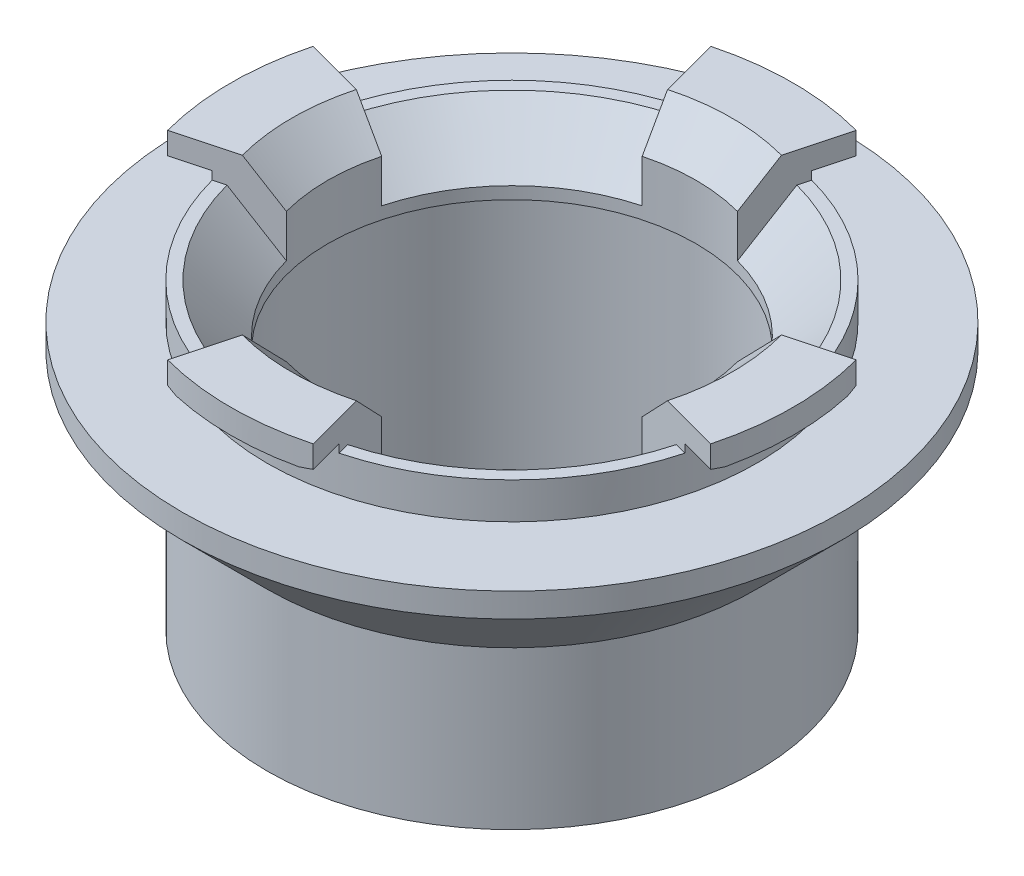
from build123d import *
from OCP.BRepFilletAPI import BRepFilletAPI_MakeChamfer
from build123d.topology import SkipClean

# Parameters (mm, degrees)
R_VOLUTION4_ANGLE            = 30
R_P_TITION_CIRCULAIRE4_COUNT = 4
CHANFREIN1_SIZE              = 1
CHANFREIN1_SIZE2             = 0.176326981


with BuildPart() as part:
    # Esquisse1 → R_volution1 (revolve)
    with BuildSketch(Plane.XY, mode=Mode.PRIVATE) as r_volution1_sk:
        Polygon((-20.2, -3), (-20.2, 0), (-19.2, 0), (-15.2, -4), (-15.2, -5), (-16.2, -5), (-16.2, -25), (-20.2, -25), (-20.2, -12), (-27.2, -5), (-27.2, -3), align=None)
    revolve(r_volution1_sk.sketch.rotate(Axis((0, 4.122794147, 0), (0, -1, 0)), 270), axis=Axis((0, 4.122794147, 0), (0, -1, 0)))

    # Esquisse2 → R_volution4 (revolve, symmetric)
    with SkipClean():  # the faces are left unmerged after this step: merging them gives an invalid solid
        with BuildSketch(Plane.XY) as r_volution4_sk:
            Polygon((-23.2, 0.5), (-20.2, 0.5), (-20.2, 0), (-19.2, 0), (-15.2, -4), (-15.2, -0.464466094), (-18.164466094, 2.5), (-23.2, 2.5), align=None)
        r_volution4 = revolve(axis=Axis((0, 5.619289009, 0), (0, -1, 0)), revolution_arc=R_VOLUTION4_ANGLE / 2)
        r_volution4 = r_volution4 + revolve(r_volution4_sk.sketch, axis=Axis((0, 5.619289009, 0), (0, 1, 0)), revolution_arc=R_VOLUTION4_ANGLE / 2)

    # R_p_tition circulaire4: R_volution4 ×4 about axis
    with SkipClean():  # the faces are left unmerged after this step: merging them gives an invalid solid
        r_p_tition_circulaire4_axis = Axis((0, 5.619289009, 0), (0, -1, 0))
        for i in range(1, R_P_TITION_CIRCULAIRE4_COUNT):
            add(r_volution4.rotate(r_p_tition_circulaire4_axis, i * 360 / R_P_TITION_CIRCULAIRE4_COUNT))

    # Chanfrein1: one chamfer whose edges measure the first distance from different faces: ONE call of the kernel's chamfer builder (chamfer() names one face for all edges)
    chanfrein1_edges_1 = [part.edges().sort_by_distance(p)[0] for p in [
        (-20.96059043, 0.5, -5.616373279),
        (-20.96059043, 0.5, 5.616373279),
    ]]
    chanfrein1_side_1 = [part.faces().sort_by_distance(p)[0] for p in [
        (-21.487134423, 0.5, 0),
    ]]
    chanfrein1_edges_2 = [part.edges().sort_by_distance(p)[0] for p in [
        (5.616373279, 0.5, -20.96059043),
        (-5.616373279, 0.5, -20.96059043),
    ]]
    chanfrein1_side_2 = [part.faces().sort_by_distance(p)[0] for p in [
        (0, 0.5, -21.487134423),
    ]]
    chanfrein1_edges_3 = [part.edges().sort_by_distance(p)[0] for p in [
        (20.96059043, 0.5, 5.616373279),
        (20.96059043, 0.5, -5.616373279),
    ]]
    chanfrein1_side_3 = [part.faces().sort_by_distance(p)[0] for p in [
        (21.487134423, 0.5, 0),
    ]]
    chanfrein1_edges_4 = [part.edges().sort_by_distance(p)[0] for p in [
        (-5.616373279, 0.5, 20.96059043),
        (5.616373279, 0.5, 20.96059043),
    ]]
    chanfrein1_side_4 = [part.faces().sort_by_distance(p)[0] for p in [
        (0, 0.5, 21.487134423),
    ]]
    chanfrein1 = BRepFilletAPI_MakeChamfer(part.part.solid().wrapped)
    for e in chanfrein1_edges_1:
        chanfrein1.Add(CHANFREIN1_SIZE, CHANFREIN1_SIZE2, e.wrapped, chanfrein1_side_1[0].wrapped)  # the first distance lies on this face
    for e in chanfrein1_edges_2:
        chanfrein1.Add(CHANFREIN1_SIZE, CHANFREIN1_SIZE2, e.wrapped, chanfrein1_side_2[0].wrapped)  # the first distance lies on this face
    for e in chanfrein1_edges_3:
        chanfrein1.Add(CHANFREIN1_SIZE, CHANFREIN1_SIZE2, e.wrapped, chanfrein1_side_3[0].wrapped)  # the first distance lies on this face
    for e in chanfrein1_edges_4:
        chanfrein1.Add(CHANFREIN1_SIZE, CHANFREIN1_SIZE2, e.wrapped, chanfrein1_side_4[0].wrapped)  # the first distance lies on this face
    add(Compound.cast(chanfrein1.Shape()), mode=Mode.REPLACE)


solid = part.part
